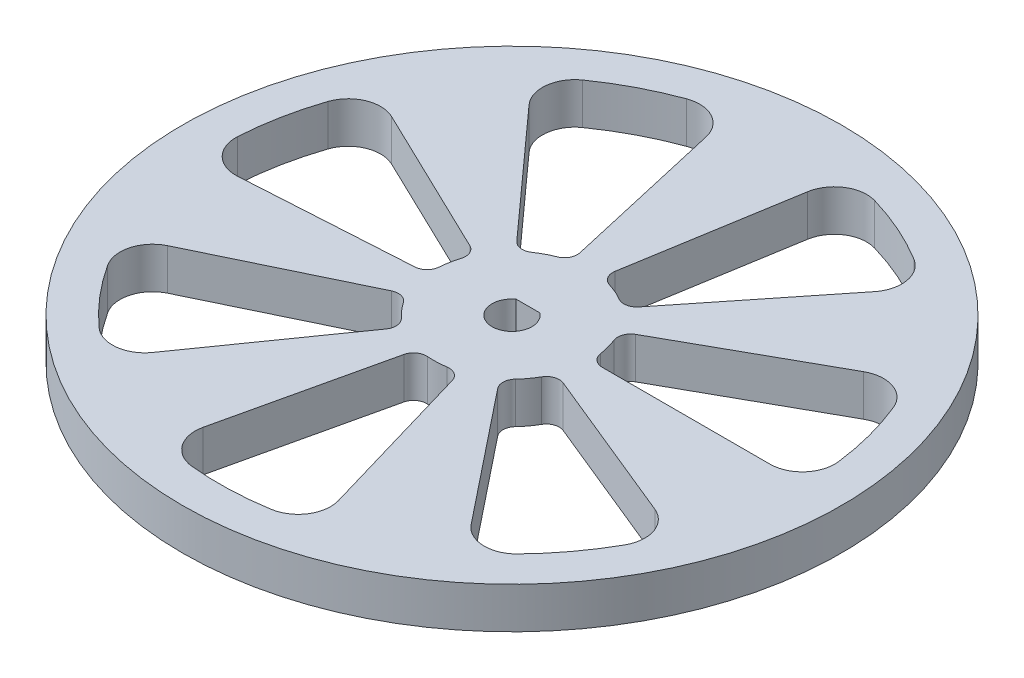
from build123d import *

# Parameters (mm, degrees)
SKETCH1_R      = 50.8
EXTRUDE1_DEPTH = 6.35


with BuildPart() as part:
    # Sketch1 → Extrude1 (new body)
    with BuildSketch(Plane(origin=(0, 0, 0), x_dir=(1, 0, 0), z_dir=(0, 1, 0))):
        with Locations(Location((0, 0, 0), (0, 0, 270))):
            Circle(SKETCH1_R)
        with BuildLine():
            Line((8.683422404, -10.88866729), (24.787973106, -31.083135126))
            ThreePointArc((24.787973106, -31.083135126), (28.449003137, -32.959525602), (32.278005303, -31.455290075))
            ThreePointArc((32.278005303, -31.455290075), (36.137357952, -26.933181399), (39.367931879, -21.942443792))
            ThreePointArc((39.367931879, -21.942443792), (39.719366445, -17.855182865), (36.894216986, -14.880668))
            Line((36.894216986, -14.880668), (12.991198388, -5.098893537))
            ThreePointArc((12.991198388, -5.098893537), (11.58020998, -5.059679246), (10.494737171, -5.961995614))
            ThreePointArc((10.494737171, -5.961995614), (9.711495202, -7.16740964), (8.790498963, -8.271156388))
            ThreePointArc((8.790498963, -8.271156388), (8.248756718, -9.559940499), (8.683422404, -10.88866729))
        make_face(mode=Mode.SUBTRACT)
        with BuildLine():
            Line((13.927128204, 0), (39.756822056, 0))
            ThreePointArc((39.756822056, 0), (43.506458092, 1.69239821), (44.717743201, 5.623908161))
            ThreePointArc((44.717743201, 5.623908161), (43.58848329, 11.460760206), (41.700797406, 17.09819861))
            ThreePointArc((41.700797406, 17.09819861), (38.724364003, 19.921326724), (34.637342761, 19.567115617))
            Line((34.637342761, 19.567115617), (12.086355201, 6.977819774))
            ThreePointArc((12.086355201, 6.977819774), (11.175959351, 5.899114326), (11.204637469, 4.487872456))
            ThreePointArc((11.204637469, 4.487872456), (11.658724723, 3.123945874), (11.947436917, 1.715707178))
            ThreePointArc((11.947436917, 1.715707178), (12.617278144, 0.488612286), (13.927128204, 0))
        make_face(mode=Mode.SUBTRACT)
        with BuildLine():
            Line((1.831876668, 2.46356), (-1.831876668, 2.46356))
            ThreePointArc((-1.831876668, 2.46356), (0, -3.07), (1.831876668, 2.46356))
        make_face(mode=Mode.SUBTRACT)
        with BuildLine():
            Line((-3.099077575, -13.577946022), (-8.846725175, -38.760035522))
            ThreePointArc((-8.846725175, -38.760035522), (-8.031131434, -42.792254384), (-4.46772894, -44.848013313))
            ThreePointArc((-4.46772894, -44.848013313), (1.474065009, -45.045888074), (7.390210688, -44.459978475))
            ThreePointArc((7.390210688, -44.459978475), (10.804875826, -42.186375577), (11.368993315, -38.123005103))
            Line((11.368993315, -38.123005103), (4.113404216, -13.336036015))
            ThreePointArc((4.113404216, -13.336036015), (3.2643263, -12.208431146), (1.88208573, -11.922359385))
            ThreePointArc((1.88208573, -11.922359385), (0.451311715, -12.061559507), (-0.985864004, -12.029670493))
            ThreePointArc((-0.985864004, -12.029670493), (-2.331246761, -12.409663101), (-3.099077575, -13.577946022))
        make_face(mode=Mode.SUBTRACT)
        with BuildLine():
            Line((-12.547908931, -6.04275446), (-35.819658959, -17.249838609))
            ThreePointArc((-35.819658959, -17.249838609), (-38.46366023, -20.401542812), (-37.849172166, -24.469267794))
            ThreePointArc((-37.849172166, -24.469267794), (-34.299228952, -29.238122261), (-30.152489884, -33.498242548))
            ThreePointArc((-30.152489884, -33.498242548), (-26.245906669, -34.750367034), (-22.717314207, -32.657941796))
            Line((-22.717314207, -32.657941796), (-7.861867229, -11.530871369))
            ThreePointArc((-7.861867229, -11.530871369), (-7.509661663, -10.163985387), (-8.147814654, -8.904943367))
            ThreePointArc((-8.147814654, -8.904943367), (-9.148718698, -7.873109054), (-10.019851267, -6.729597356))
            ThreePointArc((-10.019851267, -6.729597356), (-11.15577388, -5.914656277), (-12.547908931, -6.04275446))
        make_face(mode=Mode.SUBTRACT)
        with BuildLine():
            Line((-12.547908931, 6.04275446), (-35.819658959, 17.249838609))
            ThreePointArc((-35.819658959, 17.249838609), (-39.932268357, 17.351946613), (-42.729416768, 14.335335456))
            ThreePointArc((-42.729416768, 14.335335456), (-44.244503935, 8.586545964), (-44.989750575, 2.688353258))
            ThreePointArc((-44.989750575, 2.688353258), (-43.532986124, -1.146623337), (-39.697020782, -2.600782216))
            Line((-39.697020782, -2.600782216), (-13.916992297, -1.042725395))
            ThreePointArc((-13.916992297, -1.042725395), (-12.628721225, -0.465851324), (-12.042244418, 0.818076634))
            ThreePointArc((-12.042244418, 0.818076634), (-11.859577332, 2.243953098), (-11.508686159, 3.637999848))
            ThreePointArc((-11.508686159, 3.637999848), (-11.579775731, 5.03420736), (-12.547908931, 6.04275446))
        make_face(mode=Mode.SUBTRACT)
        with BuildLine():
            Line((-3.099077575, 13.577946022), (-8.846725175, 38.760035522))
            ThreePointArc((-8.846725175, 38.760035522), (-11.331063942, 42.039066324), (-15.433539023, 42.34513872))
            ThreePointArc((-15.433539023, 42.34513872), (-20.872765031, 39.945369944), (-25.948811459, 36.850564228))
            ThreePointArc((-25.948811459, 36.850564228), (-28.038839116, 33.32055112), (-26.784061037, 29.414819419))
            Line((-26.784061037, 29.414819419), (-9.492338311, 10.230614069))
            ThreePointArc((-9.492338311, 10.230614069), (-8.238096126, 9.583078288), (-6.868618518, 9.925068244))
            ThreePointArc((-6.868618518, 9.925068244), (-5.639932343, 10.6712728), (-4.331245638, 11.266108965))
            ThreePointArc((-4.331245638, 11.266108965), (-3.283970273, 12.192210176), (-3.099077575, 13.577946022))
        make_face(mode=Mode.SUBTRACT)
        with BuildLine():
            Line((8.683422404, 10.88866729), (24.787973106, 31.083135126))
            ThreePointArc((24.787973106, 31.083135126), (25.802662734, 35.069911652), (23.484108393, 38.468188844))
            ThreePointArc((23.484108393, 38.468188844), (18.216591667, 41.224515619), (12.632111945, 43.26354872))
            ThreePointArc((12.632111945, 43.26354872), (8.569125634, 42.696670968), (6.297842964, 39.280462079))
            Line((6.297842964, 39.280462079), (2.080240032, 13.800092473))
            ThreePointArc((2.080240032, 13.800092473), (2.355983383, 12.41575449), (3.47721722, 11.558281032))
            ThreePointArc((3.47721722, 11.558281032), (4.826696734, 11.062906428), (6.107711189, 10.410608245))
            ThreePointArc((6.107711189, 10.410608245), (7.484731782, 10.169230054), (8.683422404, 10.88866729))
        make_face(mode=Mode.SUBTRACT)
    extrude(amount=EXTRUDE1_DEPTH)


solid = part.part
